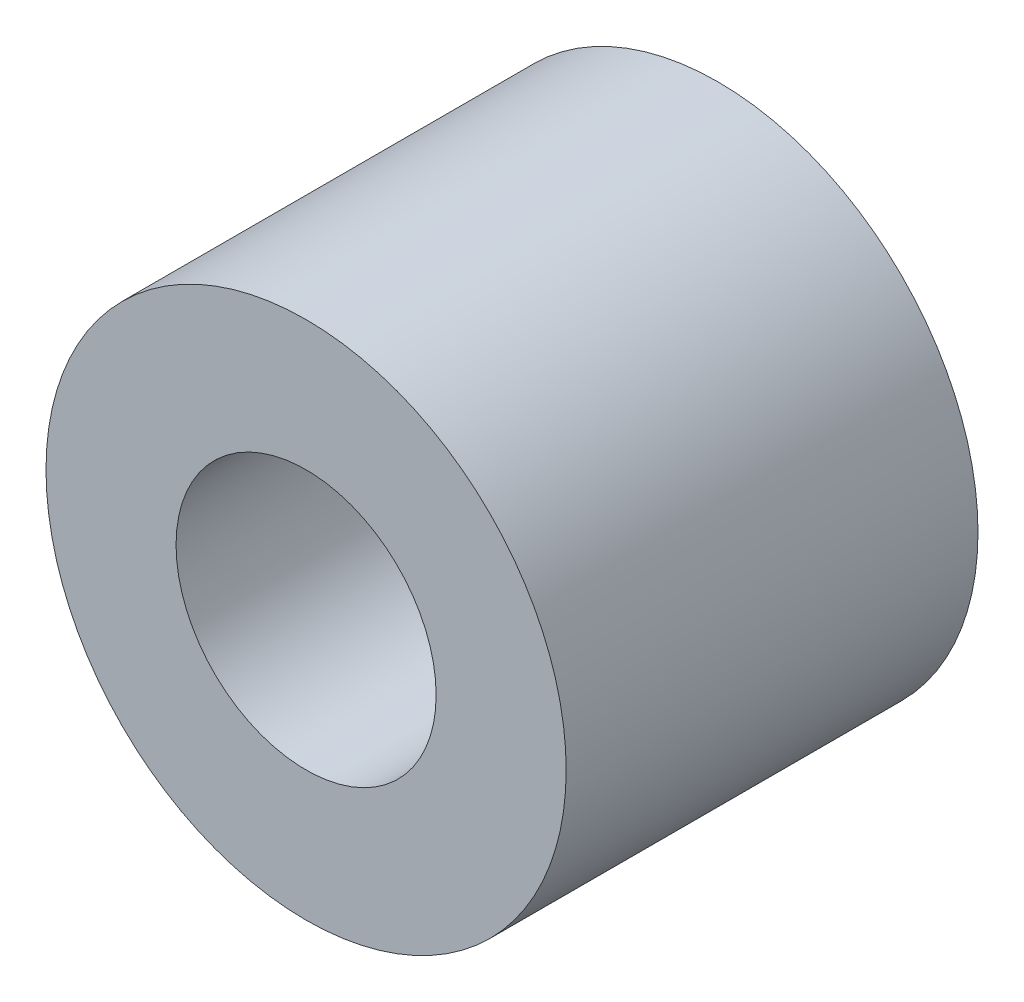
ISO-10303-21;
HEADER;
FILE_DESCRIPTION(('STEP AP214'),'2;1');
FILE_NAME('part.step','',(''),(''),'','','');
FILE_SCHEMA(('AUTOMOTIVE_DESIGN { 1 0 10303 214 1 1 1 1 }'));
ENDSEC;
DATA;
#1=APPLICATION_CONTEXT('core data for automotive mechanical design processes');
#2=APPLICATION_PROTOCOL_DEFINITION('international standard','automotive_design',2000,#1);
#3=PRODUCT_CONTEXT('',#1,'mechanical');
#4=PRODUCT('Part','Part','',(#3));
#5=PRODUCT_RELATED_PRODUCT_CATEGORY('part','',(#4));
#6=PRODUCT_DEFINITION_FORMATION('','',#4);
#7=PRODUCT_DEFINITION_CONTEXT('part definition',#1,'design');
#8=PRODUCT_DEFINITION('design','',#6,#7);
#9=PRODUCT_DEFINITION_SHAPE('','',#8);
#10=(LENGTH_UNIT() NAMED_UNIT(*) SI_UNIT(.MILLI.,.METRE.));
#11=(NAMED_UNIT(*) PLANE_ANGLE_UNIT() SI_UNIT($,.RADIAN.));
#12=(NAMED_UNIT(*) SI_UNIT($,.STERADIAN.) SOLID_ANGLE_UNIT());
#13=UNCERTAINTY_MEASURE_WITH_UNIT(LENGTH_MEASURE(1.E-05),#10,'distance_accuracy_value','');
#14=(GEOMETRIC_REPRESENTATION_CONTEXT(3) GLOBAL_UNCERTAINTY_ASSIGNED_CONTEXT((#13)) GLOBAL_UNIT_ASSIGNED_CONTEXT((#10,
#11,#12)) REPRESENTATION_CONTEXT('',''));
#15=CARTESIAN_POINT('',(0.,0.,0.));
#16=DIRECTION('',(0.,0.,1.));
#17=DIRECTION('',(1.,0.,0.));
#18=AXIS2_PLACEMENT_3D('',#15,#16,#17);
#19=CARTESIAN_POINT('',(0.,0.,9.5));
#20=DIRECTION('',(0.,0.,1.));
#21=DIRECTION('',(1.,0.,0.));
#22=AXIS2_PLACEMENT_3D('',#19,#20,#21);
#23=PLANE('',#22);
#24=CARTESIAN_POINT('',(0.,0.,9.5));
#25=DIRECTION('',(0.,0.,1.));
#26=DIRECTION('',(1.,0.,0.));
#27=AXIS2_PLACEMENT_3D('',#24,#25,#26);
#28=CIRCLE('',#27,6.);
#29=CARTESIAN_POINT('',(6.,0.,9.5));
#30=VERTEX_POINT('',#29);
#31=EDGE_CURVE('E10',#30,#30,#28,.T.);
#32=ORIENTED_EDGE('',*,*,#31,.T.);
#33=EDGE_LOOP('',(#32));
#34=FACE_BOUND('',#33,.T.);
#35=CARTESIAN_POINT('',(0.,0.,9.5));
#36=DIRECTION('',(0.,0.,1.));
#37=DIRECTION('',(1.,0.,0.));
#38=AXIS2_PLACEMENT_3D('',#35,#36,#37);
#39=CIRCLE('',#38,3.);
#40=CARTESIAN_POINT('',(3.,0.,9.5));
#41=VERTEX_POINT('',#40);
#42=EDGE_CURVE('E51',#41,#41,#39,.T.);
#43=ORIENTED_EDGE('',*,*,#42,.F.);
#44=EDGE_LOOP('',(#43));
#45=FACE_BOUND('',#44,.T.);
#46=ADVANCED_FACE('F40',(#34,#45),#23,.T.);
#47=CARTESIAN_POINT('',(0.,0.,0.));
#48=DIRECTION('',(0.,0.,1.));
#49=DIRECTION('',(1.,0.,0.));
#50=AXIS2_PLACEMENT_3D('',#47,#48,#49);
#51=PLANE('',#50);
#52=CARTESIAN_POINT('',(0.,0.,0.));
#53=DIRECTION('',(0.,0.,1.));
#54=DIRECTION('',(1.,0.,0.));
#55=AXIS2_PLACEMENT_3D('',#52,#53,#54);
#56=CIRCLE('',#55,6.);
#57=CARTESIAN_POINT('',(6.,0.,0.));
#58=VERTEX_POINT('',#57);
#59=EDGE_CURVE('E44',#58,#58,#56,.T.);
#60=ORIENTED_EDGE('',*,*,#59,.F.);
#61=EDGE_LOOP('',(#60));
#62=FACE_BOUND('',#61,.T.);
#63=CARTESIAN_POINT('',(0.,0.,0.));
#64=DIRECTION('',(0.,0.,1.));
#65=DIRECTION('',(1.,0.,0.));
#66=AXIS2_PLACEMENT_3D('',#63,#64,#65);
#67=CIRCLE('',#66,3.);
#68=CARTESIAN_POINT('',(3.,0.,0.));
#69=VERTEX_POINT('',#68);
#70=EDGE_CURVE('E53',#69,#69,#67,.T.);
#71=ORIENTED_EDGE('',*,*,#70,.T.);
#72=EDGE_LOOP('',(#71));
#73=FACE_BOUND('',#72,.T.);
#74=ADVANCED_FACE('F63',(#62,#73),#51,.F.);
#75=CARTESIAN_POINT('',(0.,0.,9.5));
#76=DIRECTION('',(0.,0.,-1.));
#77=DIRECTION('',(-1.,0.,0.));
#78=AXIS2_PLACEMENT_3D('',#75,#76,#77);
#79=CYLINDRICAL_SURFACE('',#78,6.);
#80=ORIENTED_EDGE('',*,*,#31,.F.);
#81=EDGE_LOOP('',(#80));
#82=FACE_BOUND('',#81,.T.);
#83=ORIENTED_EDGE('',*,*,#59,.T.);
#84=EDGE_LOOP('',(#83));
#85=FACE_BOUND('',#84,.T.);
#86=ADVANCED_FACE('F42',(#82,#85),#79,.T.);
#87=CARTESIAN_POINT('',(0.,0.,9.5));
#88=DIRECTION('',(0.,0.,-1.));
#89=DIRECTION('',(-1.,0.,0.));
#90=AXIS2_PLACEMENT_3D('',#87,#88,#89);
#91=CYLINDRICAL_SURFACE('',#90,3.);
#92=ORIENTED_EDGE('',*,*,#42,.T.);
#93=EDGE_LOOP('',(#92));
#94=FACE_BOUND('',#93,.T.);
#95=ORIENTED_EDGE('',*,*,#70,.F.);
#96=EDGE_LOOP('',(#95));
#97=FACE_BOUND('',#96,.T.);
#98=ADVANCED_FACE('F59',(#94,#97),#91,.F.);
#99=CLOSED_SHELL('',(#46,#74,#86,#98));
#100=MANIFOLD_SOLID_BREP('B2',#99);
#101=ADVANCED_BREP_SHAPE_REPRESENTATION('',(#18,#100),#14);
#102=SHAPE_DEFINITION_REPRESENTATION(#9,#101);
ENDSEC;
END-ISO-10303-21;
